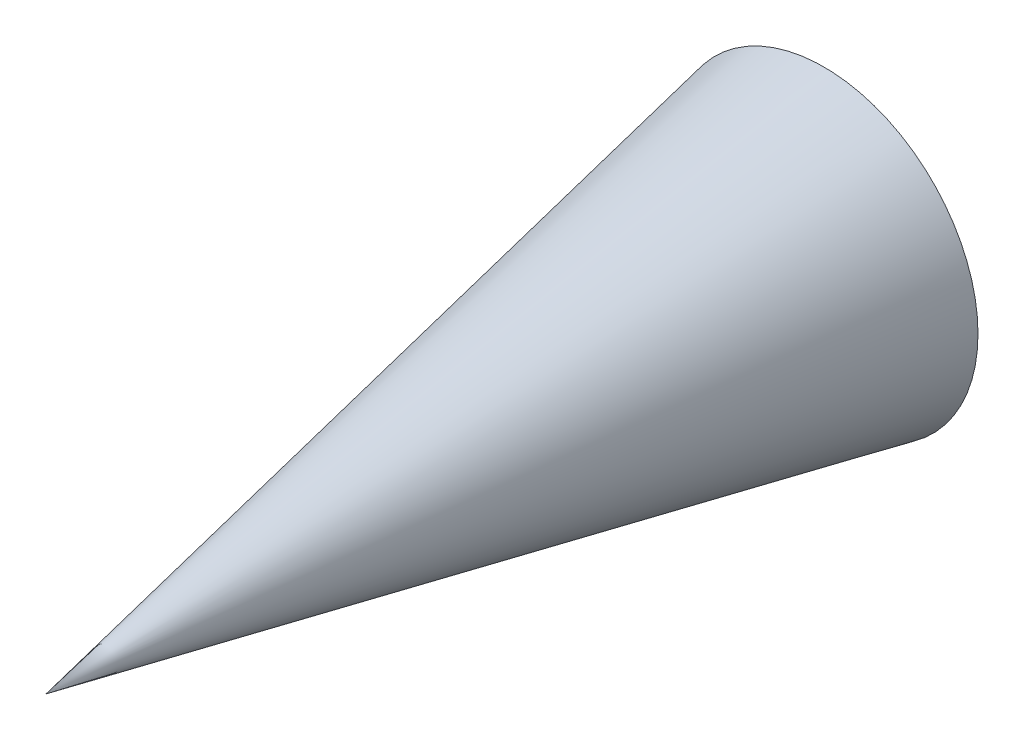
from build123d import *


with BuildPart() as part:
    # Sketch1 → light_cone (revolve)
    with BuildSketch(Plane(origin=(0, 0, 0), x_dir=(0, 0, -1), z_dir=(1, 0, 0)), mode=Mode.PRIVATE) as light_cone_sk:
        Polygon((125, 0), (125, 24.76), (0, 0), align=None)
    revolve(light_cone_sk.sketch.rotate(Axis((0, 0, 0), (0, 0, -1)), 270), axis=Axis((0, 0, 0), (0, 0, -1)))


solid = part.part
